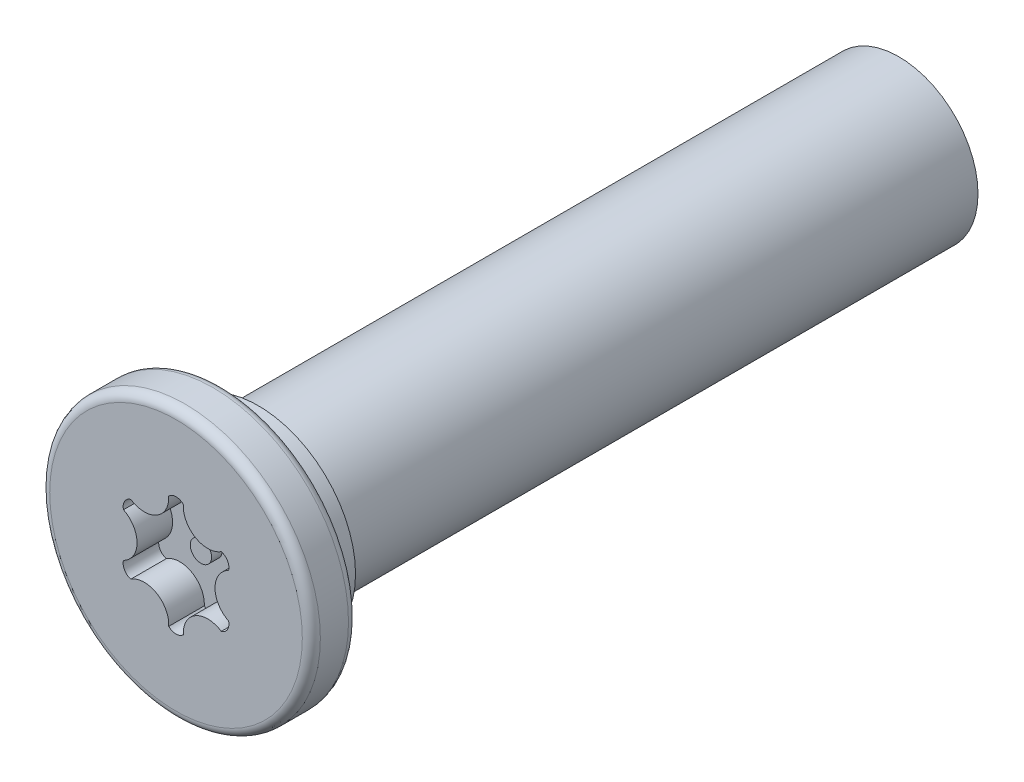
ISO-10303-21;
HEADER;
FILE_DESCRIPTION(('STEP AP214'),'2;1');
FILE_NAME('part.step','',(''),(''),'','','');
FILE_SCHEMA(('AUTOMOTIVE_DESIGN { 1 0 10303 214 1 1 1 1 }'));
ENDSEC;
DATA;
#1=APPLICATION_CONTEXT('core data for automotive mechanical design processes');
#2=APPLICATION_PROTOCOL_DEFINITION('international standard','automotive_design',2000,#1);
#3=PRODUCT_CONTEXT('',#1,'mechanical');
#4=PRODUCT('Part','Part','',(#3));
#5=PRODUCT_RELATED_PRODUCT_CATEGORY('part','',(#4));
#6=PRODUCT_DEFINITION_FORMATION('','',#4);
#7=PRODUCT_DEFINITION_CONTEXT('part definition',#1,'design');
#8=PRODUCT_DEFINITION('design','',#6,#7);
#9=PRODUCT_DEFINITION_SHAPE('','',#8);
#10=(LENGTH_UNIT() NAMED_UNIT(*) SI_UNIT(.MILLI.,.METRE.));
#11=(NAMED_UNIT(*) PLANE_ANGLE_UNIT() SI_UNIT($,.RADIAN.));
#12=(NAMED_UNIT(*) SI_UNIT($,.STERADIAN.) SOLID_ANGLE_UNIT());
#13=UNCERTAINTY_MEASURE_WITH_UNIT(LENGTH_MEASURE(1.E-05),#10,'distance_accuracy_value','');
#14=(GEOMETRIC_REPRESENTATION_CONTEXT(3) GLOBAL_UNCERTAINTY_ASSIGNED_CONTEXT((#13)) GLOBAL_UNIT_ASSIGNED_CONTEXT((#10,
#11,#12)) REPRESENTATION_CONTEXT('',''));
#15=CARTESIAN_POINT('',(0.,0.,0.));
#16=DIRECTION('',(0.,0.,1.));
#17=DIRECTION('',(1.,0.,0.));
#18=AXIS2_PLACEMENT_3D('',#15,#16,#17);
#19=CARTESIAN_POINT('',(0.,0.,0.));
#20=DIRECTION('',(0.,0.,1.));
#21=DIRECTION('',(1.,0.,0.));
#22=AXIS2_PLACEMENT_3D('',#19,#20,#21);
#23=PLANE('',#22);
#24=CARTESIAN_POINT('',(0.,0.,0.));
#25=DIRECTION('',(0.,0.,1.));
#26=DIRECTION('',(1.,0.,0.));
#27=AXIS2_PLACEMENT_3D('',#24,#25,#26);
#28=CIRCLE('',#27,3.55599999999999);
#29=CARTESIAN_POINT('',(3.55599999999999,0.,0.));
#30=VERTEX_POINT('',#29);
#31=EDGE_CURVE('E54',#30,#30,#28,.T.);
#32=ORIENTED_EDGE('',*,*,#31,.T.);
#33=EDGE_LOOP('',(#32));
#34=FACE_BOUND('',#33,.T.);
#35=CARTESIAN_POINT('',(0.893828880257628,1.54815703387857,0.));
#36=DIRECTION('',(0.,0.,1.));
#37=DIRECTION('',(1.,0.,0.));
#38=AXIS2_PLACEMENT_3D('',#35,#36,#37);
#39=CIRCLE('',#38,0.69);
#40=CARTESIAN_POINT('',(0.205060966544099,1.58937306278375,0.));
#41=VERTEX_POINT('',#40);
#42=CARTESIAN_POINT('',(1.27390696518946,0.972274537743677,0.));
#43=VERTEX_POINT('',#42);
#44=EDGE_CURVE('E181',#41,#43,#39,.T.);
#45=ORIENTED_EDGE('',*,*,#44,.T.);
#46=CARTESIAN_POINT('',(1.19884944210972,0.692156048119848,0.));
#47=DIRECTION('',(0.,0.,1.));
#48=DIRECTION('',(1.,0.,0.));
#49=AXIS2_PLACEMENT_3D('',#46,#47,#48);
#50=CIRCLE('',#49,0.29);
#51=CARTESIAN_POINT('',(1.47896793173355,0.617098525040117,0.));
#52=VERTEX_POINT('',#51);
#53=EDGE_CURVE('E61',#43,#52,#50,.F.);
#54=ORIENTED_EDGE('',*,*,#53,.T.);
#55=CARTESIAN_POINT('',(1.78765776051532,0.,0.));
#56=DIRECTION('',(0.,0.,1.));
#57=DIRECTION('',(1.,0.,0.));
#58=AXIS2_PLACEMENT_3D('',#55,#56,#57);
#59=CIRCLE('',#58,0.69);
#60=CARTESIAN_POINT('',(1.47896793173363,-0.617098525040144,0.));
#61=VERTEX_POINT('',#60);
#62=EDGE_CURVE('E111',#52,#61,#59,.T.);
#63=ORIENTED_EDGE('',*,*,#62,.T.);
#64=CARTESIAN_POINT('',(1.1988494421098,-0.692156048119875,0.));
#65=DIRECTION('',(0.,0.,1.));
#66=DIRECTION('',(1.,0.,0.));
#67=AXIS2_PLACEMENT_3D('',#64,#65,#66);
#68=CIRCLE('',#67,0.29);
#69=CARTESIAN_POINT('',(1.27390696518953,-0.972274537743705,0.));
#70=VERTEX_POINT('',#69);
#71=EDGE_CURVE('E216',#61,#70,#68,.F.);
#72=ORIENTED_EDGE('',*,*,#71,.T.);
#73=CARTESIAN_POINT('',(0.893828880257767,-1.54815703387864,0.));
#74=DIRECTION('',(0.,0.,1.));
#75=DIRECTION('',(1.,0.,0.));
#76=AXIS2_PLACEMENT_3D('',#73,#74,#75);
#77=CIRCLE('',#76,0.69);
#78=CARTESIAN_POINT('',(0.205060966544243,-1.5893730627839,0.));
#79=VERTEX_POINT('',#78);
#80=EDGE_CURVE('E160',#70,#79,#77,.T.);
#81=ORIENTED_EDGE('',*,*,#80,.T.);
#82=CARTESIAN_POINT('',(1.43067375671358E-13,-1.3843120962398,0.));
#83=DIRECTION('',(0.,0.,1.));
#84=DIRECTION('',(1.,0.,0.));
#85=AXIS2_PLACEMENT_3D('',#82,#83,#84);
#86=CIRCLE('',#85,0.29);
#87=CARTESIAN_POINT('',(-0.205060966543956,-1.5893730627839,0.));
#88=VERTEX_POINT('',#87);
#89=EDGE_CURVE('E210',#79,#88,#86,.F.);
#90=ORIENTED_EDGE('',*,*,#89,.T.);
#91=CARTESIAN_POINT('',(-0.893828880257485,-1.54815703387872,0.));
#92=DIRECTION('',(0.,0.,1.));
#93=DIRECTION('',(1.,0.,0.));
#94=AXIS2_PLACEMENT_3D('',#91,#92,#93);
#95=CIRCLE('',#94,0.69);
#96=CARTESIAN_POINT('',(-1.27390696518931,-0.97227453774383,0.));
#97=VERTEX_POINT('',#96);
#98=EDGE_CURVE('E206',#88,#97,#95,.T.);
#99=ORIENTED_EDGE('',*,*,#98,.T.);
#100=CARTESIAN_POINT('',(-1.19884944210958,-0.69215604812,0.));
#101=DIRECTION('',(0.,0.,1.));
#102=DIRECTION('',(1.,0.,0.));
#103=AXIS2_PLACEMENT_3D('',#100,#101,#102);
#104=CIRCLE('',#103,0.29);
#105=CARTESIAN_POINT('',(-1.47896793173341,-0.617098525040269,0.));
#106=VERTEX_POINT('',#105);
#107=EDGE_CURVE('E202',#97,#106,#104,.F.);
#108=ORIENTED_EDGE('',*,*,#107,.T.);
#109=CARTESIAN_POINT('',(-1.78765776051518,-1.56674837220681E-13,0.));
#110=DIRECTION('',(0.,0.,1.));
#111=DIRECTION('',(1.,0.,0.));
#112=AXIS2_PLACEMENT_3D('',#109,#110,#111);
#113=CIRCLE('',#112,0.69);
#114=CARTESIAN_POINT('',(-1.47896793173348,0.617098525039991,0.));
#115=VERTEX_POINT('',#114);
#116=EDGE_CURVE('E198',#106,#115,#113,.T.);
#117=ORIENTED_EDGE('',*,*,#116,.T.);
#118=CARTESIAN_POINT('',(-1.19884944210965,0.692156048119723,0.));
#119=DIRECTION('',(0.,0.,1.));
#120=DIRECTION('',(1.,0.,0.));
#121=AXIS2_PLACEMENT_3D('',#118,#119,#120);
#122=CIRCLE('',#121,0.29);
#123=CARTESIAN_POINT('',(-1.27390696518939,0.972274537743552,0.));
#124=VERTEX_POINT('',#123);
#125=EDGE_CURVE('E194',#115,#124,#122,.F.);
#126=ORIENTED_EDGE('',*,*,#125,.T.);
#127=CARTESIAN_POINT('',(-0.893828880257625,1.54815703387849,0.));
#128=DIRECTION('',(0.,0.,1.));
#129=DIRECTION('',(1.,0.,0.));
#130=AXIS2_PLACEMENT_3D('',#127,#128,#129);
#131=CIRCLE('',#130,0.690000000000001);
#132=CARTESIAN_POINT('',(-0.205060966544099,1.58937306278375,0.));
#133=VERTEX_POINT('',#132);
#134=EDGE_CURVE('E190',#124,#133,#131,.T.);
#135=ORIENTED_EDGE('',*,*,#134,.T.);
#136=CARTESIAN_POINT('',(0.,1.38431209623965,0.));
#137=DIRECTION('',(0.,0.,1.));
#138=DIRECTION('',(1.,0.,0.));
#139=AXIS2_PLACEMENT_3D('',#136,#137,#138);
#140=CIRCLE('',#139,0.29);
#141=EDGE_CURVE('E186',#133,#41,#140,.F.);
#142=ORIENTED_EDGE('',*,*,#141,.T.);
#143=EDGE_LOOP('',(#45,#54,#63,#72,#81,#90,#99,#108,#117,#126,#135,#142));
#144=FACE_BOUND('',#143,.T.);
#145=ADVANCED_FACE('F45',(#34,#144),#23,.T.);
#146=CARTESIAN_POINT('',(0.,0.,-1.3));
#147=DIRECTION('',(0.,0.,1.));
#148=DIRECTION('',(1.,0.,0.));
#149=AXIS2_PLACEMENT_3D('',#146,#147,#148);
#150=PLANE('',#149);
#151=CARTESIAN_POINT('',(0.,0.,-1.3));
#152=DIRECTION('',(0.,0.,1.));
#153=DIRECTION('',(1.,0.,0.));
#154=AXIS2_PLACEMENT_3D('',#151,#152,#153);
#155=CIRCLE('',#154,2.738000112);
#156=CARTESIAN_POINT('',(2.738000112,0.,-1.3));
#157=VERTEX_POINT('',#156);
#158=EDGE_CURVE('E11',#157,#157,#155,.F.);
#159=ORIENTED_EDGE('',*,*,#158,.F.);
#160=EDGE_LOOP('',(#159));
#161=FACE_BOUND('',#160,.T.);
#162=CARTESIAN_POINT('',(0.,0.,-1.3));
#163=DIRECTION('',(0.,0.,1.));
#164=DIRECTION('',(1.,0.,0.));
#165=AXIS2_PLACEMENT_3D('',#162,#163,#164);
#166=CIRCLE('',#165,3.55599999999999);
#167=CARTESIAN_POINT('',(3.55599999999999,0.,-1.3));
#168=VERTEX_POINT('',#167);
#169=EDGE_CURVE('E260',#168,#168,#166,.F.);
#170=ORIENTED_EDGE('',*,*,#169,.T.);
#171=EDGE_LOOP('',(#170));
#172=FACE_BOUND('',#171,.T.);
#173=ADVANCED_FACE('F283',(#161,#172),#150,.F.);
#174=CARTESIAN_POINT('',(0.,0.,-1.3));
#175=DIRECTION('',(0.,0.,1.));
#176=DIRECTION('',(1.,0.,0.));
#177=AXIS2_PLACEMENT_3D('',#174,#175,#176);
#178=CYLINDRICAL_SURFACE('',#177,3.80999999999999);
#179=CARTESIAN_POINT('',(0.,0.,-1.046));
#180=DIRECTION('',(0.,0.,1.));
#181=DIRECTION('',(1.,0.,0.));
#182=AXIS2_PLACEMENT_3D('',#179,#180,#181);
#183=CIRCLE('',#182,3.80999999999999);
#184=CARTESIAN_POINT('',(3.80999999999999,0.,-1.046));
#185=VERTEX_POINT('',#184);
#186=EDGE_CURVE('E256',#185,#185,#183,.T.);
#187=ORIENTED_EDGE('',*,*,#186,.T.);
#188=EDGE_LOOP('',(#187));
#189=FACE_BOUND('',#188,.T.);
#190=CARTESIAN_POINT('',(0.,0.,-0.254));
#191=DIRECTION('',(0.,0.,1.));
#192=DIRECTION('',(1.,0.,0.));
#193=AXIS2_PLACEMENT_3D('',#190,#191,#192);
#194=CIRCLE('',#193,3.80999999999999);
#195=CARTESIAN_POINT('',(3.80999999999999,0.,-0.254));
#196=VERTEX_POINT('',#195);
#197=EDGE_CURVE('E225',#196,#196,#194,.F.);
#198=ORIENTED_EDGE('',*,*,#197,.T.);
#199=EDGE_LOOP('',(#198));
#200=FACE_BOUND('',#199,.T.);
#201=ADVANCED_FACE('F289',(#189,#200),#178,.T.);
#202=CARTESIAN_POINT('',(1.19884944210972,0.692156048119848,-1.));
#203=DIRECTION('',(0.,0.,1.));
#204=DIRECTION('',(1.,0.,0.));
#205=AXIS2_PLACEMENT_3D('',#202,#203,#204);
#206=CYLINDRICAL_SURFACE('',#205,0.29);
#207=ORIENTED_EDGE('',*,*,#53,.F.);
#208=DIRECTION('',(0.,0.,1.));
#209=VECTOR('',#208,1.);
#210=CARTESIAN_POINT('',(1.27390696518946,0.972274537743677,-1.));
#211=LINE('',#210,#209);
#212=CARTESIAN_POINT('',(1.27390696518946,0.972274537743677,-1.));
#213=VERTEX_POINT('',#212);
#214=EDGE_CURVE('E178',#213,#43,#211,.T.);
#215=ORIENTED_EDGE('',*,*,#214,.F.);
#216=CARTESIAN_POINT('',(1.19884944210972,0.692156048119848,-1.));
#217=DIRECTION('',(0.,0.,1.));
#218=DIRECTION('',(1.,0.,0.));
#219=AXIS2_PLACEMENT_3D('',#216,#217,#218);
#220=CIRCLE('',#219,0.29);
#221=CARTESIAN_POINT('',(1.47896793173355,0.617098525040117,-1.));
#222=VERTEX_POINT('',#221);
#223=EDGE_CURVE('E221',#213,#222,#220,.F.);
#224=ORIENTED_EDGE('',*,*,#223,.T.);
#225=DIRECTION('',(0.,0.,1.));
#226=VECTOR('',#225,1.);
#227=CARTESIAN_POINT('',(1.47896793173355,0.617098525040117,-1.));
#228=LINE('',#227,#226);
#229=EDGE_CURVE('E222',#222,#52,#228,.T.);
#230=ORIENTED_EDGE('',*,*,#229,.T.);
#231=EDGE_LOOP('',(#207,#215,#224,#230));
#232=FACE_BOUND('',#231,.T.);
#233=ADVANCED_FACE('F294',(#232),#206,.F.);
#234=CARTESIAN_POINT('',(1.78765776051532,0.,-1.));
#235=DIRECTION('',(0.,0.,1.));
#236=DIRECTION('',(1.,0.,0.));
#237=AXIS2_PLACEMENT_3D('',#234,#235,#236);
#238=CYLINDRICAL_SURFACE('',#237,0.69);
#239=ORIENTED_EDGE('',*,*,#62,.F.);
#240=ORIENTED_EDGE('',*,*,#229,.F.);
#241=CARTESIAN_POINT('',(1.78765776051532,0.,-1.));
#242=DIRECTION('',(0.,0.,1.));
#243=DIRECTION('',(1.,0.,0.));
#244=AXIS2_PLACEMENT_3D('',#241,#242,#243);
#245=CIRCLE('',#244,0.69);
#246=CARTESIAN_POINT('',(1.47896793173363,-0.617098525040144,-1.));
#247=VERTEX_POINT('',#246);
#248=EDGE_CURVE('E70',#222,#247,#245,.T.);
#249=ORIENTED_EDGE('',*,*,#248,.T.);
#250=DIRECTION('',(0.,0.,1.));
#251=VECTOR('',#250,1.);
#252=CARTESIAN_POINT('',(1.47896793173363,-0.617098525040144,-1.));
#253=LINE('',#252,#251);
#254=EDGE_CURVE('E151',#247,#61,#253,.T.);
#255=ORIENTED_EDGE('',*,*,#254,.T.);
#256=EDGE_LOOP('',(#239,#240,#249,#255));
#257=FACE_BOUND('',#256,.T.);
#258=ADVANCED_FACE('F301',(#257),#238,.T.);
#259=CARTESIAN_POINT('',(1.1988494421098,-0.692156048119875,-1.));
#260=DIRECTION('',(0.,0.,1.));
#261=DIRECTION('',(1.,0.,0.));
#262=AXIS2_PLACEMENT_3D('',#259,#260,#261);
#263=CYLINDRICAL_SURFACE('',#262,0.29);
#264=ORIENTED_EDGE('',*,*,#71,.F.);
#265=ORIENTED_EDGE('',*,*,#254,.F.);
#266=CARTESIAN_POINT('',(1.1988494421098,-0.692156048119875,-1.));
#267=DIRECTION('',(0.,0.,1.));
#268=DIRECTION('',(1.,0.,0.));
#269=AXIS2_PLACEMENT_3D('',#266,#267,#268);
#270=CIRCLE('',#269,0.29);
#271=CARTESIAN_POINT('',(1.27390696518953,-0.972274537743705,-1.));
#272=VERTEX_POINT('',#271);
#273=EDGE_CURVE('E145',#247,#272,#270,.F.);
#274=ORIENTED_EDGE('',*,*,#273,.T.);
#275=DIRECTION('',(0.,0.,1.));
#276=VECTOR('',#275,1.);
#277=CARTESIAN_POINT('',(1.27390696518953,-0.972274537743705,-1.));
#278=LINE('',#277,#276);
#279=EDGE_CURVE('E149',#272,#70,#278,.T.);
#280=ORIENTED_EDGE('',*,*,#279,.T.);
#281=EDGE_LOOP('',(#264,#265,#274,#280));
#282=FACE_BOUND('',#281,.T.);
#283=ADVANCED_FACE('F148',(#282),#263,.F.);
#284=CARTESIAN_POINT('',(0.893828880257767,-1.54815703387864,-1.));
#285=DIRECTION('',(0.,0.,1.));
#286=DIRECTION('',(1.,0.,0.));
#287=AXIS2_PLACEMENT_3D('',#284,#285,#286);
#288=CYLINDRICAL_SURFACE('',#287,0.69);
#289=ORIENTED_EDGE('',*,*,#80,.F.);
#290=ORIENTED_EDGE('',*,*,#279,.F.);
#291=CARTESIAN_POINT('',(0.893828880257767,-1.54815703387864,-1.));
#292=DIRECTION('',(0.,0.,1.));
#293=DIRECTION('',(1.,0.,0.));
#294=AXIS2_PLACEMENT_3D('',#291,#292,#293);
#295=CIRCLE('',#294,0.69);
#296=CARTESIAN_POINT('',(0.205060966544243,-1.5893730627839,-1.));
#297=VERTEX_POINT('',#296);
#298=EDGE_CURVE('E154',#272,#297,#295,.T.);
#299=ORIENTED_EDGE('',*,*,#298,.T.);
#300=DIRECTION('',(0.,0.,1.));
#301=VECTOR('',#300,1.);
#302=CARTESIAN_POINT('',(0.205060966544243,-1.5893730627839,-1.));
#303=LINE('',#302,#301);
#304=EDGE_CURVE('E163',#297,#79,#303,.T.);
#305=ORIENTED_EDGE('',*,*,#304,.T.);
#306=EDGE_LOOP('',(#289,#290,#299,#305));
#307=FACE_BOUND('',#306,.T.);
#308=ADVANCED_FACE('F157',(#307),#288,.T.);
#309=CARTESIAN_POINT('',(1.43067375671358E-13,-1.3843120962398,-1.));
#310=DIRECTION('',(0.,0.,1.));
#311=DIRECTION('',(1.,0.,0.));
#312=AXIS2_PLACEMENT_3D('',#309,#310,#311);
#313=CYLINDRICAL_SURFACE('',#312,0.29);
#314=ORIENTED_EDGE('',*,*,#89,.F.);
#315=ORIENTED_EDGE('',*,*,#304,.F.);
#316=CARTESIAN_POINT('',(1.43067375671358E-13,-1.3843120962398,-1.));
#317=DIRECTION('',(0.,0.,1.));
#318=DIRECTION('',(1.,0.,0.));
#319=AXIS2_PLACEMENT_3D('',#316,#317,#318);
#320=CIRCLE('',#319,0.29);
#321=CARTESIAN_POINT('',(-0.205060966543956,-1.5893730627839,-1.));
#322=VERTEX_POINT('',#321);
#323=EDGE_CURVE('E168',#297,#322,#320,.F.);
#324=ORIENTED_EDGE('',*,*,#323,.T.);
#325=DIRECTION('',(0.,0.,1.));
#326=VECTOR('',#325,1.);
#327=CARTESIAN_POINT('',(-0.205060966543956,-1.5893730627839,-1.));
#328=LINE('',#327,#326);
#329=EDGE_CURVE('E230',#322,#88,#328,.T.);
#330=ORIENTED_EDGE('',*,*,#329,.T.);
#331=EDGE_LOOP('',(#314,#315,#324,#330));
#332=FACE_BOUND('',#331,.T.);
#333=ADVANCED_FACE('F318',(#332),#313,.F.);
#334=CARTESIAN_POINT('',(-0.893828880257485,-1.54815703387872,-1.));
#335=DIRECTION('',(0.,0.,1.));
#336=DIRECTION('',(1.,0.,0.));
#337=AXIS2_PLACEMENT_3D('',#334,#335,#336);
#338=CYLINDRICAL_SURFACE('',#337,0.69);
#339=ORIENTED_EDGE('',*,*,#98,.F.);
#340=ORIENTED_EDGE('',*,*,#329,.F.);
#341=CARTESIAN_POINT('',(-0.893828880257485,-1.54815703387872,-1.));
#342=DIRECTION('',(0.,0.,1.));
#343=DIRECTION('',(1.,0.,0.));
#344=AXIS2_PLACEMENT_3D('',#341,#342,#343);
#345=CIRCLE('',#344,0.69);
#346=CARTESIAN_POINT('',(-1.27390696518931,-0.97227453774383,-1.));
#347=VERTEX_POINT('',#346);
#348=EDGE_CURVE('E172',#322,#347,#345,.T.);
#349=ORIENTED_EDGE('',*,*,#348,.T.);
#350=DIRECTION('',(0.,0.,1.));
#351=VECTOR('',#350,1.);
#352=CARTESIAN_POINT('',(-1.27390696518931,-0.97227453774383,-1.));
#353=LINE('',#352,#351);
#354=EDGE_CURVE('E233',#347,#97,#353,.T.);
#355=ORIENTED_EDGE('',*,*,#354,.T.);
#356=EDGE_LOOP('',(#339,#340,#349,#355));
#357=FACE_BOUND('',#356,.T.);
#358=ADVANCED_FACE('F321',(#357),#338,.T.);
#359=CARTESIAN_POINT('',(-1.19884944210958,-0.69215604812,-1.));
#360=DIRECTION('',(0.,0.,1.));
#361=DIRECTION('',(1.,0.,0.));
#362=AXIS2_PLACEMENT_3D('',#359,#360,#361);
#363=CYLINDRICAL_SURFACE('',#362,0.29);
#364=ORIENTED_EDGE('',*,*,#107,.F.);
#365=ORIENTED_EDGE('',*,*,#354,.F.);
#366=CARTESIAN_POINT('',(-1.19884944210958,-0.69215604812,-1.));
#367=DIRECTION('',(0.,0.,1.));
#368=DIRECTION('',(1.,0.,0.));
#369=AXIS2_PLACEMENT_3D('',#366,#367,#368);
#370=CIRCLE('',#369,0.29);
#371=CARTESIAN_POINT('',(-1.47896793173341,-0.617098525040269,-1.));
#372=VERTEX_POINT('',#371);
#373=EDGE_CURVE('E374',#347,#372,#370,.F.);
#374=ORIENTED_EDGE('',*,*,#373,.T.);
#375=DIRECTION('',(0.,0.,1.));
#376=VECTOR('',#375,1.);
#377=CARTESIAN_POINT('',(-1.47896793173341,-0.617098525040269,-1.));
#378=LINE('',#377,#376);
#379=EDGE_CURVE('E236',#372,#106,#378,.T.);
#380=ORIENTED_EDGE('',*,*,#379,.T.);
#381=EDGE_LOOP('',(#364,#365,#374,#380));
#382=FACE_BOUND('',#381,.T.);
#383=ADVANCED_FACE('F325',(#382),#363,.F.);
#384=CARTESIAN_POINT('',(-1.78765776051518,-1.56674837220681E-13,-1.));
#385=DIRECTION('',(0.,0.,1.));
#386=DIRECTION('',(1.,0.,0.));
#387=AXIS2_PLACEMENT_3D('',#384,#385,#386);
#388=CYLINDRICAL_SURFACE('',#387,0.69);
#389=ORIENTED_EDGE('',*,*,#116,.F.);
#390=ORIENTED_EDGE('',*,*,#379,.F.);
#391=CARTESIAN_POINT('',(-1.78765776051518,-1.56674837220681E-13,-1.));
#392=DIRECTION('',(0.,0.,1.));
#393=DIRECTION('',(1.,0.,0.));
#394=AXIS2_PLACEMENT_3D('',#391,#392,#393);
#395=CIRCLE('',#394,0.69);
#396=CARTESIAN_POINT('',(-1.47896793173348,0.617098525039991,-1.));
#397=VERTEX_POINT('',#396);
#398=EDGE_CURVE('E371',#372,#397,#395,.T.);
#399=ORIENTED_EDGE('',*,*,#398,.T.);
#400=DIRECTION('',(0.,0.,1.));
#401=VECTOR('',#400,1.);
#402=CARTESIAN_POINT('',(-1.47896793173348,0.617098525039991,-1.));
#403=LINE('',#402,#401);
#404=EDGE_CURVE('E239',#397,#115,#403,.T.);
#405=ORIENTED_EDGE('',*,*,#404,.T.);
#406=EDGE_LOOP('',(#389,#390,#399,#405));
#407=FACE_BOUND('',#406,.T.);
#408=ADVANCED_FACE('F329',(#407),#388,.T.);
#409=CARTESIAN_POINT('',(-1.19884944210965,0.692156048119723,-1.));
#410=DIRECTION('',(0.,0.,1.));
#411=DIRECTION('',(1.,0.,0.));
#412=AXIS2_PLACEMENT_3D('',#409,#410,#411);
#413=CYLINDRICAL_SURFACE('',#412,0.29);
#414=ORIENTED_EDGE('',*,*,#125,.F.);
#415=ORIENTED_EDGE('',*,*,#404,.F.);
#416=CARTESIAN_POINT('',(-1.19884944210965,0.692156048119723,-1.));
#417=DIRECTION('',(0.,0.,1.));
#418=DIRECTION('',(1.,0.,0.));
#419=AXIS2_PLACEMENT_3D('',#416,#417,#418);
#420=CIRCLE('',#419,0.29);
#421=CARTESIAN_POINT('',(-1.27390696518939,0.972274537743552,-1.));
#422=VERTEX_POINT('',#421);
#423=EDGE_CURVE('E364',#397,#422,#420,.F.);
#424=ORIENTED_EDGE('',*,*,#423,.T.);
#425=DIRECTION('',(0.,0.,1.));
#426=VECTOR('',#425,1.);
#427=CARTESIAN_POINT('',(-1.27390696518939,0.972274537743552,-1.));
#428=LINE('',#427,#426);
#429=EDGE_CURVE('E242',#422,#124,#428,.T.);
#430=ORIENTED_EDGE('',*,*,#429,.T.);
#431=EDGE_LOOP('',(#414,#415,#424,#430));
#432=FACE_BOUND('',#431,.T.);
#433=ADVANCED_FACE('F333',(#432),#413,.F.);
#434=CARTESIAN_POINT('',(-0.893828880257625,1.54815703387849,-1.));
#435=DIRECTION('',(0.,0.,1.));
#436=DIRECTION('',(1.,0.,0.));
#437=AXIS2_PLACEMENT_3D('',#434,#435,#436);
#438=CYLINDRICAL_SURFACE('',#437,0.690000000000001);
#439=ORIENTED_EDGE('',*,*,#134,.F.);
#440=ORIENTED_EDGE('',*,*,#429,.F.);
#441=CARTESIAN_POINT('',(-0.893828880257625,1.54815703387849,-1.));
#442=DIRECTION('',(0.,0.,1.));
#443=DIRECTION('',(1.,0.,0.));
#444=AXIS2_PLACEMENT_3D('',#441,#442,#443);
#445=CIRCLE('',#444,0.690000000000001);
#446=CARTESIAN_POINT('',(-0.205060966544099,1.58937306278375,-1.));
#447=VERTEX_POINT('',#446);
#448=EDGE_CURVE('E360',#422,#447,#445,.T.);
#449=ORIENTED_EDGE('',*,*,#448,.T.);
#450=DIRECTION('',(0.,0.,1.));
#451=VECTOR('',#450,1.);
#452=CARTESIAN_POINT('',(-0.205060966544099,1.58937306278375,-1.));
#453=LINE('',#452,#451);
#454=EDGE_CURVE('E245',#447,#133,#453,.T.);
#455=ORIENTED_EDGE('',*,*,#454,.T.);
#456=EDGE_LOOP('',(#439,#440,#449,#455));
#457=FACE_BOUND('',#456,.T.);
#458=ADVANCED_FACE('F337',(#457),#438,.T.);
#459=CARTESIAN_POINT('',(0.,1.38431209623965,-1.));
#460=DIRECTION('',(0.,0.,1.));
#461=DIRECTION('',(1.,0.,0.));
#462=AXIS2_PLACEMENT_3D('',#459,#460,#461);
#463=CYLINDRICAL_SURFACE('',#462,0.29);
#464=ORIENTED_EDGE('',*,*,#141,.F.);
#465=ORIENTED_EDGE('',*,*,#454,.F.);
#466=CARTESIAN_POINT('',(0.,1.38431209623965,-1.));
#467=DIRECTION('',(0.,0.,1.));
#468=DIRECTION('',(1.,0.,0.));
#469=AXIS2_PLACEMENT_3D('',#466,#467,#468);
#470=CIRCLE('',#469,0.29);
#471=CARTESIAN_POINT('',(0.205060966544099,1.58937306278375,-1.));
#472=VERTEX_POINT('',#471);
#473=EDGE_CURVE('E357',#447,#472,#470,.F.);
#474=ORIENTED_EDGE('',*,*,#473,.T.);
#475=DIRECTION('',(0.,0.,1.));
#476=VECTOR('',#475,1.);
#477=CARTESIAN_POINT('',(0.205060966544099,1.58937306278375,-1.));
#478=LINE('',#477,#476);
#479=EDGE_CURVE('E248',#472,#41,#478,.T.);
#480=ORIENTED_EDGE('',*,*,#479,.T.);
#481=EDGE_LOOP('',(#464,#465,#474,#480));
#482=FACE_BOUND('',#481,.T.);
#483=ADVANCED_FACE('F341',(#482),#463,.F.);
#484=CARTESIAN_POINT('',(0.893828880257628,1.54815703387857,-1.));
#485=DIRECTION('',(0.,0.,1.));
#486=DIRECTION('',(1.,0.,0.));
#487=AXIS2_PLACEMENT_3D('',#484,#485,#486);
#488=CYLINDRICAL_SURFACE('',#487,0.69);
#489=ORIENTED_EDGE('',*,*,#44,.F.);
#490=ORIENTED_EDGE('',*,*,#479,.F.);
#491=CARTESIAN_POINT('',(0.893828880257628,1.54815703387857,-1.));
#492=DIRECTION('',(0.,0.,1.));
#493=DIRECTION('',(1.,0.,0.));
#494=AXIS2_PLACEMENT_3D('',#491,#492,#493);
#495=CIRCLE('',#494,0.69);
#496=EDGE_CURVE('E118',#472,#213,#495,.T.);
#497=ORIENTED_EDGE('',*,*,#496,.T.);
#498=ORIENTED_EDGE('',*,*,#214,.T.);
#499=EDGE_LOOP('',(#489,#490,#497,#498));
#500=FACE_BOUND('',#499,.T.);
#501=ADVANCED_FACE('F344',(#500),#488,.T.);
#502=CARTESIAN_POINT('',(0.,0.,-1.));
#503=DIRECTION('',(0.,0.,1.));
#504=DIRECTION('',(1.,0.,0.));
#505=AXIS2_PLACEMENT_3D('',#502,#503,#504);
#506=PLANE('',#505);
#507=CARTESIAN_POINT('',(0.,0.,-1.));
#508=DIRECTION('',(0.,0.,1.));
#509=DIRECTION('',(1.,0.,0.));
#510=AXIS2_PLACEMENT_3D('',#507,#508,#509);
#511=CIRCLE('',#510,0.3);
#512=CARTESIAN_POINT('',(0.3,0.,-1.));
#513=VERTEX_POINT('',#512);
#514=EDGE_CURVE('E396',#513,#513,#511,.T.);
#515=ORIENTED_EDGE('',*,*,#514,.F.);
#516=EDGE_LOOP('',(#515));
#517=FACE_BOUND('',#516,.T.);
#518=ORIENTED_EDGE('',*,*,#223,.F.);
#519=ORIENTED_EDGE('',*,*,#496,.F.);
#520=ORIENTED_EDGE('',*,*,#473,.F.);
#521=ORIENTED_EDGE('',*,*,#448,.F.);
#522=ORIENTED_EDGE('',*,*,#423,.F.);
#523=ORIENTED_EDGE('',*,*,#398,.F.);
#524=ORIENTED_EDGE('',*,*,#373,.F.);
#525=ORIENTED_EDGE('',*,*,#348,.F.);
#526=ORIENTED_EDGE('',*,*,#323,.F.);
#527=ORIENTED_EDGE('',*,*,#298,.F.);
#528=ORIENTED_EDGE('',*,*,#273,.F.);
#529=ORIENTED_EDGE('',*,*,#248,.F.);
#530=EDGE_LOOP('',(#518,#519,#520,#521,#522,#523,#524,#525,#526,#527,#528,#529));
#531=FACE_BOUND('',#530,.T.);
#532=ADVANCED_FACE('F166',(#517,#531),#506,.T.);
#533=CARTESIAN_POINT('',(0.,0.,-1.046));
#534=DIRECTION('',(0.,0.,1.));
#535=DIRECTION('',(1.,0.,0.));
#536=AXIS2_PLACEMENT_3D('',#533,#534,#535);
#537=TOROIDAL_SURFACE('',#536,3.55599999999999,0.254);
#538=ORIENTED_EDGE('',*,*,#169,.F.);
#539=EDGE_LOOP('',(#538));
#540=FACE_BOUND('',#539,.T.);
#541=ORIENTED_EDGE('',*,*,#186,.F.);
#542=EDGE_LOOP('',(#541));
#543=FACE_BOUND('',#542,.T.);
#544=ADVANCED_FACE('F271',(#540,#543),#537,.T.);
#545=CARTESIAN_POINT('',(0.,0.,-0.254));
#546=DIRECTION('',(0.,0.,1.));
#547=DIRECTION('',(1.,0.,0.));
#548=AXIS2_PLACEMENT_3D('',#545,#546,#547);
#549=TOROIDAL_SURFACE('',#548,3.55599999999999,0.254);
#550=ORIENTED_EDGE('',*,*,#197,.F.);
#551=EDGE_LOOP('',(#550));
#552=FACE_BOUND('',#551,.T.);
#553=ORIENTED_EDGE('',*,*,#31,.F.);
#554=EDGE_LOOP('',(#553));
#555=FACE_BOUND('',#554,.T.);
#556=ADVANCED_FACE('F47',(#552,#555),#549,.T.);
#557=CARTESIAN_POINT('',(0.,0.,-2.316));
#558=DIRECTION('',(0.,0.,-1.));
#559=DIRECTION('',(-1.,0.,0.));
#560=AXIS2_PLACEMENT_3D('',#557,#558,#559);
#561=PLANE('',#560);
#562=CARTESIAN_POINT('',(0.,0.,-2.316));
#563=DIRECTION('',(0.,0.,-1.));
#564=DIRECTION('',(-1.,0.,0.));
#565=AXIS2_PLACEMENT_3D('',#562,#563,#564);
#566=CIRCLE('',#565,2.738000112);
#567=CARTESIAN_POINT('',(-2.738000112,0.,-2.316));
#568=VERTEX_POINT('',#567);
#569=EDGE_CURVE('E182',#568,#568,#566,.T.);
#570=ORIENTED_EDGE('',*,*,#569,.T.);
#571=EDGE_LOOP('',(#570));
#572=FACE_BOUND('',#571,.T.);
#573=CARTESIAN_POINT('',(0.,0.,-2.316));
#574=DIRECTION('',(0.,0.,-1.));
#575=DIRECTION('',(-1.,0.,0.));
#576=AXIS2_PLACEMENT_3D('',#573,#574,#575);
#577=CIRCLE('',#576,2.230000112);
#578=CARTESIAN_POINT('',(2.230000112,0.,-2.316));
#579=VERTEX_POINT('',#578);
#580=EDGE_CURVE('E400',#579,#579,#577,.T.);
#581=ORIENTED_EDGE('',*,*,#580,.F.);
#582=EDGE_LOOP('',(#581));
#583=FACE_BOUND('',#582,.T.);
#584=ADVANCED_FACE('F270',(#572,#583),#561,.T.);
#585=CARTESIAN_POINT('',(0.,0.,-2.316));
#586=DIRECTION('',(0.,0.,1.));
#587=DIRECTION('',(1.,0.,0.));
#588=AXIS2_PLACEMENT_3D('',#585,#586,#587);
#589=CYLINDRICAL_SURFACE('',#588,2.738000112);
#590=ORIENTED_EDGE('',*,*,#569,.F.);
#591=EDGE_LOOP('',(#590));
#592=FACE_BOUND('',#591,.T.);
#593=ORIENTED_EDGE('',*,*,#158,.T.);
#594=EDGE_LOOP('',(#593));
#595=FACE_BOUND('',#594,.T.);
#596=ADVANCED_FACE('F277',(#592,#595),#589,.T.);
#597=CARTESIAN_POINT('',(0.,0.,-0.7));
#598=DIRECTION('',(0.,0.,-1.));
#599=DIRECTION('',(-1.,0.,0.));
#600=AXIS2_PLACEMENT_3D('',#597,#598,#599);
#601=CYLINDRICAL_SURFACE('',#600,0.3);
#602=CARTESIAN_POINT('',(0.,0.,-0.7));
#603=DIRECTION('',(0.,0.,1.));
#604=DIRECTION('',(1.,0.,0.));
#605=AXIS2_PLACEMENT_3D('',#602,#603,#604);
#606=CIRCLE('',#605,0.3);
#607=CARTESIAN_POINT('',(0.3,0.,-0.7));
#608=VERTEX_POINT('',#607);
#609=EDGE_CURVE('E395',#608,#608,#606,.T.);
#610=ORIENTED_EDGE('',*,*,#609,.F.);
#611=EDGE_LOOP('',(#610));
#612=FACE_BOUND('',#611,.T.);
#613=ORIENTED_EDGE('',*,*,#514,.T.);
#614=EDGE_LOOP('',(#613));
#615=FACE_BOUND('',#614,.T.);
#616=ADVANCED_FACE('F424',(#612,#615),#601,.T.);
#617=CARTESIAN_POINT('',(0.,0.,-0.7));
#618=DIRECTION('',(0.,0.,1.));
#619=DIRECTION('',(1.,0.,0.));
#620=AXIS2_PLACEMENT_3D('',#617,#618,#619);
#621=PLANE('',#620);
#622=ORIENTED_EDGE('',*,*,#609,.T.);
#623=EDGE_LOOP('',(#622));
#624=FACE_BOUND('',#623,.T.);
#625=ADVANCED_FACE('F416',(#624),#621,.T.);
#626=CARTESIAN_POINT('',(0.,0.,-20.35));
#627=DIRECTION('',(0.,0.,1.));
#628=DIRECTION('',(1.,0.,0.));
#629=AXIS2_PLACEMENT_3D('',#626,#627,#628);
#630=CYLINDRICAL_SURFACE('',#629,2.230000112);
#631=CARTESIAN_POINT('',(0.,0.,-20.35));
#632=DIRECTION('',(0.,0.,-1.));
#633=DIRECTION('',(-1.,0.,0.));
#634=AXIS2_PLACEMENT_3D('',#631,#632,#633);
#635=CIRCLE('',#634,2.230000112);
#636=CARTESIAN_POINT('',(2.230000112,0.,-20.35));
#637=VERTEX_POINT('',#636);
#638=EDGE_CURVE('E407',#637,#637,#635,.T.);
#639=CARTESIAN_POINT('',(2.230000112,0.,-2.316));
#640=CARTESIAN_POINT('',(2.230000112,0.,-2.50385416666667));
#641=CARTESIAN_POINT('',(2.230000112,0.,-2.69170833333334));
#642=CARTESIAN_POINT('',(2.230000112,0.,-3.06741666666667));
#643=CARTESIAN_POINT('',(2.230000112,0.,-3.25527083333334));
#644=CARTESIAN_POINT('',(2.230000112,0.,-3.63097916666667));
#645=CARTESIAN_POINT('',(2.230000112,0.,-3.81883333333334));
#646=CARTESIAN_POINT('',(2.230000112,0.,-4.19454166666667));
#647=CARTESIAN_POINT('',(2.230000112,0.,-4.38239583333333));
#648=CARTESIAN_POINT('',(2.230000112,0.,-4.75810416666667));
#649=CARTESIAN_POINT('',(2.230000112,0.,-4.94595833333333));
#650=CARTESIAN_POINT('',(2.230000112,0.,-5.32166666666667));
#651=CARTESIAN_POINT('',(2.230000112,0.,-5.50952083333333));
#652=CARTESIAN_POINT('',(2.230000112,0.,-5.88522916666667));
#653=CARTESIAN_POINT('',(2.230000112,0.,-6.07308333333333));
#654=CARTESIAN_POINT('',(2.230000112,0.,-6.44879166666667));
#655=CARTESIAN_POINT('',(2.230000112,0.,-6.63664583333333));
#656=CARTESIAN_POINT('',(2.230000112,0.,-7.01235416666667));
#657=CARTESIAN_POINT('',(2.230000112,0.,-7.20020833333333));
#658=CARTESIAN_POINT('',(2.230000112,0.,-7.57591666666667));
#659=CARTESIAN_POINT('',(2.230000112,0.,-7.76377083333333));
#660=CARTESIAN_POINT('',(2.230000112,0.,-8.13947916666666));
#661=CARTESIAN_POINT('',(2.230000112,0.,-8.32733333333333));
#662=CARTESIAN_POINT('',(2.230000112,0.,-8.70304166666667));
#663=CARTESIAN_POINT('',(2.230000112,0.,-8.89089583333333));
#664=CARTESIAN_POINT('',(2.230000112,0.,-9.26660416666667));
#665=CARTESIAN_POINT('',(2.230000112,0.,-9.45445833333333));
#666=CARTESIAN_POINT('',(2.230000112,0.,-9.83016666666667));
#667=CARTESIAN_POINT('',(2.230000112,0.,-10.0180208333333));
#668=CARTESIAN_POINT('',(2.230000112,0.,-10.3937291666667));
#669=CARTESIAN_POINT('',(2.230000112,0.,-10.5815833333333));
#670=CARTESIAN_POINT('',(2.230000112,0.,-10.9572916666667));
#671=CARTESIAN_POINT('',(2.230000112,0.,-11.1451458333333));
#672=CARTESIAN_POINT('',(2.230000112,0.,-11.5208541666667));
#673=CARTESIAN_POINT('',(2.230000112,0.,-11.7087083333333));
#674=CARTESIAN_POINT('',(2.230000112,0.,-12.0844166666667));
#675=CARTESIAN_POINT('',(2.230000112,0.,-12.2722708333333));
#676=CARTESIAN_POINT('',(2.230000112,0.,-12.6479791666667));
#677=CARTESIAN_POINT('',(2.230000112,0.,-12.8358333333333));
#678=CARTESIAN_POINT('',(2.230000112,0.,-13.2115416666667));
#679=CARTESIAN_POINT('',(2.230000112,0.,-13.3993958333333));
#680=CARTESIAN_POINT('',(2.230000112,0.,-13.7751041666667));
#681=CARTESIAN_POINT('',(2.230000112,0.,-13.9629583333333));
#682=CARTESIAN_POINT('',(2.230000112,0.,-14.3386666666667));
#683=CARTESIAN_POINT('',(2.230000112,0.,-14.5265208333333));
#684=CARTESIAN_POINT('',(2.230000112,0.,-14.9022291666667));
#685=CARTESIAN_POINT('',(2.230000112,0.,-15.0900833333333));
#686=CARTESIAN_POINT('',(2.230000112,0.,-15.4657916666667));
#687=CARTESIAN_POINT('',(2.230000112,0.,-15.6536458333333));
#688=CARTESIAN_POINT('',(2.230000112,0.,-16.0293541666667));
#689=CARTESIAN_POINT('',(2.230000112,0.,-16.2172083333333));
#690=CARTESIAN_POINT('',(2.230000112,0.,-16.5929166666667));
#691=CARTESIAN_POINT('',(2.230000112,0.,-16.7807708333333));
#692=CARTESIAN_POINT('',(2.230000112,0.,-17.1564791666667));
#693=CARTESIAN_POINT('',(2.230000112,0.,-17.3443333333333));
#694=CARTESIAN_POINT('',(2.230000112,0.,-17.7200416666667));
#695=CARTESIAN_POINT('',(2.230000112,0.,-17.9078958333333));
#696=CARTESIAN_POINT('',(2.230000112,0.,-18.2836041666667));
#697=CARTESIAN_POINT('',(2.230000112,0.,-18.4714583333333));
#698=CARTESIAN_POINT('',(2.230000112,0.,-18.8471666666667));
#699=CARTESIAN_POINT('',(2.230000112,0.,-19.0350208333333));
#700=CARTESIAN_POINT('',(2.230000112,0.,-19.4107291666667));
#701=CARTESIAN_POINT('',(2.230000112,0.,-19.5985833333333));
#702=CARTESIAN_POINT('',(2.230000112,0.,-19.9742916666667));
#703=CARTESIAN_POINT('',(2.230000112,0.,-20.1621458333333));
#704=CARTESIAN_POINT('',(2.230000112,0.,-20.35));
#705=B_SPLINE_CURVE_WITH_KNOTS('',3,(#639,#640,#641,#642,#643,#644,#645,#646,#647,#648,#649,
#650,#651,#652,#653,#654,#655,#656,#657,#658,#659,#660,#661,#662,#663,#664,#665,#666,#667,#668,
#669,#670,#671,#672,#673,#674,#675,#676,#677,#678,#679,#680,#681,#682,#683,#684,#685,#686,#687,
#688,#689,#690,#691,#692,#693,#694,#695,#696,#697,#698,#699,#700,#701,#702,#703,#704),
.UNSPECIFIED.,.F.,.F.,(4,2,2,2,2,2,2,2,2,2,2,2,2,2,2,2,2,2,2,2,2,2,2,2,2,2,2,2,2,2,2,2,4),(0.,
0.5635625,1.127125,1.6906875,2.25425,2.8178125,3.381375,3.9449375,4.5085,5.0720625,5.635625,
6.1991875,6.76275,7.3263125,7.889875,8.4534375,9.017,9.5805625,10.144125,10.7076875,11.27125,
11.8348125,12.398375,12.9619375,13.5255,14.0890625,14.652625,15.2161875,15.77975,16.3433125,
16.906875,17.4704375,18.034),.UNSPECIFIED.);
#706=EDGE_CURVE('BSEAM414',#579,#637,#705,.T.);
#707=ORIENTED_EDGE('',*,*,#580,.T.);
#708=ORIENTED_EDGE('',*,*,#638,.F.);
#709=ORIENTED_EDGE('',*,*,#706,.T.);
#710=ORIENTED_EDGE('',*,*,#706,.F.);
#711=EDGE_LOOP('',(#707,#709,#708,#710));
#712=FACE_BOUND('',#711,.T.);
#713=ADVANCED_FACE('F414',(#712),#630,.T.);
#714=CARTESIAN_POINT('',(0.,0.,-20.35));
#715=DIRECTION('',(0.,0.,-1.));
#716=DIRECTION('',(-1.,0.,0.));
#717=AXIS2_PLACEMENT_3D('',#714,#715,#716);
#718=PLANE('',#717);
#719=ORIENTED_EDGE('',*,*,#638,.T.);
#720=EDGE_LOOP('',(#719));
#721=FACE_BOUND('',#720,.T.);
#722=ADVANCED_FACE('F412',(#721),#718,.T.);
#723=CLOSED_SHELL('',(#145,#173,#201,#233,#258,#283,#308,#333,#358,#383,#408,#433,#458,#483,
#501,#532,#544,#556,#584,#596,#616,#625,#713,#722));
#724=MANIFOLD_SOLID_BREP('B2',#723);
#725=ADVANCED_BREP_SHAPE_REPRESENTATION('',(#18,#724),#14);
#726=SHAPE_DEFINITION_REPRESENTATION(#9,#725);
ENDSEC;
END-ISO-10303-21;
